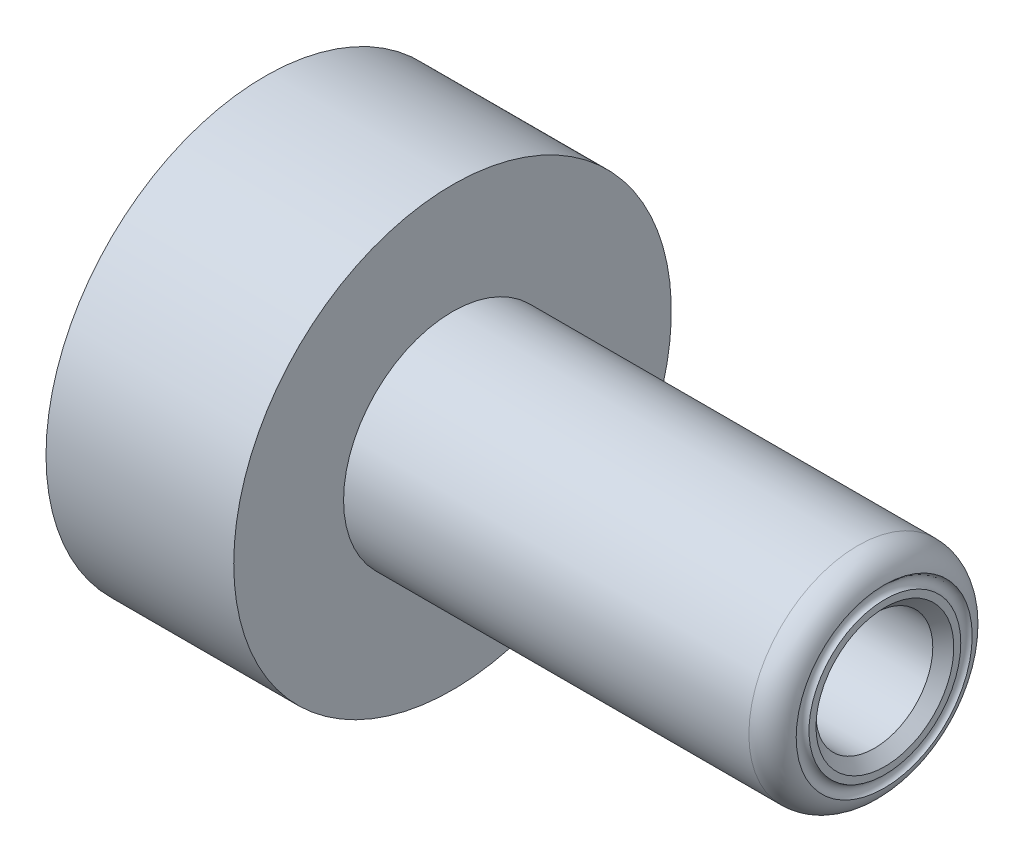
from build123d import *

# Parameters (mm, degrees)
SKETCH2_R          = 1.6129
CUT_EXTRUDE1_DEPTH = 6.35
SKETCH3_R          = 3.39
CUT_EXTRUDE2_DEPTH = 41.224242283
CHAMFER1_SIZE      = 0.61
SKETCH4_R          = 0.381


with BuildPart() as part:
    # Sketch1 → Revolve1 (revolve)
    with BuildSketch(Plane.XY, mode=Mode.PRIVATE) as revolve1_sk:
        with BuildLine():
            Line((0, 3.9751), (0, 12.7))
            Line((0, 12.7), (10.8966, 12.7))
            Line((10.8966, 12.7), (10.8966, 6.3246))
            Line((10.8966, 6.3246), (34.4218, 6.3246))
            ThreePointArc((34.4218, 6.3246), (35.531957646, 5.864757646), (35.9918, 4.7546))
            Line((35.9918, 4.7546), (35.9918, 0))
            Line((35.9918, 0), (21.8948, 0))
            Line((21.8948, 0), (21.8948, 3.9751))
            Line((21.8948, 3.9751), (0, 3.9751))
        make_face()
    revolve(revolve1_sk.sketch.rotate(Axis((0, 0, 0), (1, 0, 0)), 90), axis=Axis((0, 0, 0), (1, 0, 0)))

    # Sketch2 → Cut-Extrude1 (cut)
    with BuildSketch(Plane.ZY):
        with Locations((-7.1374, 0)):
            Circle(SKETCH2_R)
        with Locations(Location((7.1374, 0, 0), (0, 0, 180))):
            Circle(SKETCH2_R)
    extrude(amount=-CUT_EXTRUDE1_DEPTH, mode=Mode.SUBTRACT)

    # Sketch3 → Cut-Extrude2 (cut, through all)
    with BuildSketch(Plane(origin=(35.9918, 0, 0), x_dir=(0, 0, -1), z_dir=(1, 0, 0))):
        Circle(SKETCH3_R)
    extrude(amount=-CUT_EXTRUDE2_DEPTH, mode=Mode.SUBTRACT)

    # Chamfer1
    chamfer1_edges = [part.edges().sort_by_distance(p)[0] for p in [
        (35.9918, 0, 3.39),
    ]]
    chamfer(chamfer1_edges, length=CHAMFER1_SIZE)

    # Sketch4 → Cut-Revolve1 (revolve, cut)
    with BuildSketch(Plane.XY, mode=Mode.PRIVATE) as cut_revolve1_sk:
        with Locations((36.117, 4.765)):
            Circle(SKETCH4_R)
    revolve(cut_revolve1_sk.sketch.rotate(Axis((0, 0, 0), (1, 0, 0)), 90), axis=Axis((0, 0, 0), (1, 0, 0)), mode=Mode.SUBTRACT)


solid = part.part
